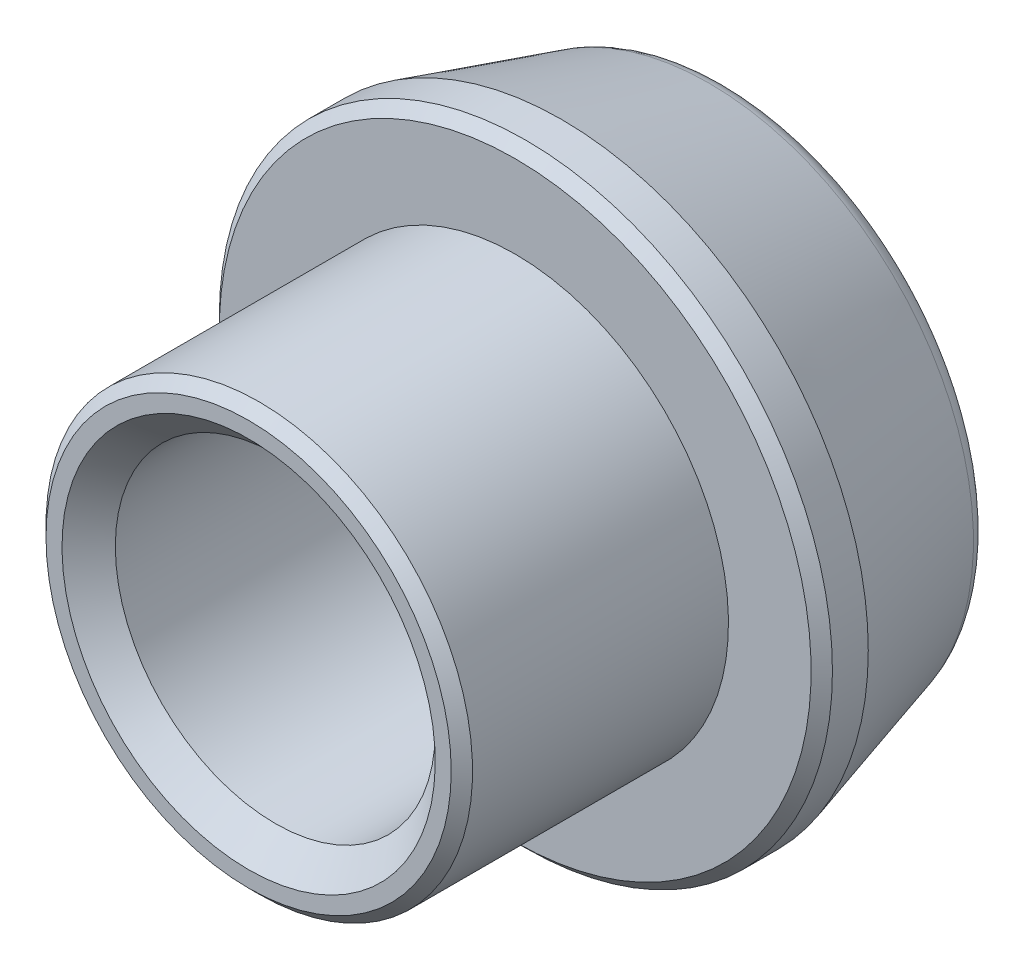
ISO-10303-21;
HEADER;
FILE_DESCRIPTION(('STEP AP214'),'2;1');
FILE_NAME('part.step','',(''),(''),'','','');
FILE_SCHEMA(('AUTOMOTIVE_DESIGN { 1 0 10303 214 1 1 1 1 }'));
ENDSEC;
DATA;
#1=APPLICATION_CONTEXT('core data for automotive mechanical design processes');
#2=APPLICATION_PROTOCOL_DEFINITION('international standard','automotive_design',2000,#1);
#3=PRODUCT_CONTEXT('',#1,'mechanical');
#4=PRODUCT('Part','Part','',(#3));
#5=PRODUCT_RELATED_PRODUCT_CATEGORY('part','',(#4));
#6=PRODUCT_DEFINITION_FORMATION('','',#4);
#7=PRODUCT_DEFINITION_CONTEXT('part definition',#1,'design');
#8=PRODUCT_DEFINITION('design','',#6,#7);
#9=PRODUCT_DEFINITION_SHAPE('','',#8);
#10=(LENGTH_UNIT() NAMED_UNIT(*) SI_UNIT(.MILLI.,.METRE.));
#11=(NAMED_UNIT(*) PLANE_ANGLE_UNIT() SI_UNIT($,.RADIAN.));
#12=(NAMED_UNIT(*) SI_UNIT($,.STERADIAN.) SOLID_ANGLE_UNIT());
#13=UNCERTAINTY_MEASURE_WITH_UNIT(LENGTH_MEASURE(1.E-05),#10,'distance_accuracy_value','');
#14=(GEOMETRIC_REPRESENTATION_CONTEXT(3) GLOBAL_UNCERTAINTY_ASSIGNED_CONTEXT((#13)) GLOBAL_UNIT_ASSIGNED_CONTEXT((#10,
#11,#12)) REPRESENTATION_CONTEXT('',''));
#15=CARTESIAN_POINT('',(0.,0.,0.));
#16=DIRECTION('',(0.,0.,1.));
#17=DIRECTION('',(1.,0.,0.));
#18=AXIS2_PLACEMENT_3D('',#15,#16,#17);
#19=CARTESIAN_POINT('',(0.,0.,0.));
#20=DIRECTION('',(0.,0.,-1.));
#21=DIRECTION('',(0.,1.,0.));
#22=AXIS2_PLACEMENT_3D('',#19,#20,#21);
#23=CYLINDRICAL_SURFACE('',#22,4.);
#24=CARTESIAN_POINT('',(0.,0.,4.8));
#25=DIRECTION('',(0.,0.,1.));
#26=DIRECTION('',(0.,-1.,0.));
#27=AXIS2_PLACEMENT_3D('',#24,#25,#26);
#28=CIRCLE('',#27,4.);
#29=CARTESIAN_POINT('',(0.,-4.,4.8));
#30=VERTEX_POINT('',#29);
#31=EDGE_CURVE('E20',#30,#30,#28,.F.);
#32=ORIENTED_EDGE('',*,*,#31,.T.);
#33=EDGE_LOOP('',(#32));
#34=FACE_BOUND('',#33,.T.);
#35=CARTESIAN_POINT('',(0.,0.,0.));
#36=DIRECTION('',(0.,0.,-1.));
#37=DIRECTION('',(0.,1.,0.));
#38=AXIS2_PLACEMENT_3D('',#35,#36,#37);
#39=CIRCLE('',#38,4.);
#40=CARTESIAN_POINT('',(0.,4.,0.));
#41=VERTEX_POINT('',#40);
#42=EDGE_CURVE('E44',#41,#41,#39,.T.);
#43=ORIENTED_EDGE('',*,*,#42,.F.);
#44=EDGE_LOOP('',(#43));
#45=FACE_BOUND('',#44,.T.);
#46=ADVANCED_FACE('F12',(#34,#45),#23,.T.);
#47=CARTESIAN_POINT('',(4.,0.,0.));
#48=DIRECTION('',(0.,0.,1.));
#49=DIRECTION('',(0.,-1.,0.));
#50=AXIS2_PLACEMENT_3D('',#47,#48,#49);
#51=PLANE('',#50);
#52=CARTESIAN_POINT('',(0.,0.,0.));
#53=DIRECTION('',(0.,0.,1.));
#54=DIRECTION('',(0.,-1.,0.));
#55=AXIS2_PLACEMENT_3D('',#52,#53,#54);
#56=CIRCLE('',#55,5.55);
#57=CARTESIAN_POINT('',(0.,-5.55,0.));
#58=VERTEX_POINT('',#57);
#59=EDGE_CURVE('E32',#58,#58,#56,.T.);
#60=ORIENTED_EDGE('',*,*,#59,.T.);
#61=EDGE_LOOP('',(#60));
#62=FACE_BOUND('',#61,.T.);
#63=ORIENTED_EDGE('',*,*,#42,.T.);
#64=EDGE_LOOP('',(#63));
#65=FACE_BOUND('',#64,.T.);
#66=ADVANCED_FACE('F83',(#62,#65),#51,.T.);
#67=CARTESIAN_POINT('',(0.,0.,0.));
#68=DIRECTION('',(0.,0.,-1.));
#69=DIRECTION('',(0.,1.,0.));
#70=AXIS2_PLACEMENT_3D('',#67,#68,#69);
#71=CYLINDRICAL_SURFACE('',#70,5.75);
#72=CARTESIAN_POINT('',(0.,0.,-0.199999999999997));
#73=DIRECTION('',(0.,0.,1.));
#74=DIRECTION('',(0.,-1.,0.));
#75=AXIS2_PLACEMENT_3D('',#72,#73,#74);
#76=CIRCLE('',#75,5.75);
#77=CARTESIAN_POINT('',(0.,-5.75,-0.199999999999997));
#78=VERTEX_POINT('',#77);
#79=EDGE_CURVE('E35',#78,#78,#76,.F.);
#80=ORIENTED_EDGE('',*,*,#79,.T.);
#81=EDGE_LOOP('',(#80));
#82=FACE_BOUND('',#81,.T.);
#83=CARTESIAN_POINT('',(0.,0.,-0.871853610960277));
#84=DIRECTION('',(0.,0.,-1.));
#85=DIRECTION('',(0.,1.,0.));
#86=AXIS2_PLACEMENT_3D('',#83,#84,#85);
#87=CIRCLE('',#86,5.75);
#88=CARTESIAN_POINT('',(0.,5.75,-0.871853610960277));
#89=VERTEX_POINT('',#88);
#90=EDGE_CURVE('E47',#89,#89,#87,.T.);
#91=ORIENTED_EDGE('',*,*,#90,.F.);
#92=EDGE_LOOP('',(#91));
#93=FACE_BOUND('',#92,.T.);
#94=ADVANCED_FACE('F89',(#82,#93),#71,.T.);
#95=CARTESIAN_POINT('',(0.,0.,-4.));
#96=DIRECTION('',(0.,0.,1.));
#97=DIRECTION('',(0.,-1.,0.));
#98=AXIS2_PLACEMENT_3D('',#95,#96,#97);
#99=CONICAL_SURFACE('',#98,4.85301845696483,0.279252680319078);
#100=CARTESIAN_POINT('',(0.,0.,-3.63781867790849));
#101=DIRECTION('',(0.,0.,-1.));
#102=DIRECTION('',(0.,1.,0.));
#103=AXIS2_PLACEMENT_3D('',#100,#101,#102);
#104=CIRCLE('',#103,4.95687227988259);
#105=CARTESIAN_POINT('',(0.,4.95687227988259,-3.63781867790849));
#106=VERTEX_POINT('',#105);
#107=EDGE_CURVE('E38',#106,#106,#104,.F.);
#108=ORIENTED_EDGE('',*,*,#107,.T.);
#109=EDGE_LOOP('',(#108));
#110=FACE_BOUND('',#109,.T.);
#111=ORIENTED_EDGE('',*,*,#90,.T.);
#112=EDGE_LOOP('',(#111));
#113=FACE_BOUND('',#112,.T.);
#114=ADVANCED_FACE('F78',(#110,#113),#99,.T.);
#115=CARTESIAN_POINT('',(2.5,0.,-4.));
#116=DIRECTION('',(0.,0.,-1.));
#117=DIRECTION('',(0.,1.,0.));
#118=AXIS2_PLACEMENT_3D('',#115,#116,#117);
#119=PLANE('',#118);
#120=CARTESIAN_POINT('',(0.,0.,-4.));
#121=DIRECTION('',(0.,0.,-1.));
#122=DIRECTION('',(0.,1.,0.));
#123=AXIS2_PLACEMENT_3D('',#120,#121,#122);
#124=CIRCLE('',#123,3.5);
#125=CARTESIAN_POINT('',(0.,3.5,-4.));
#126=VERTEX_POINT('',#125);
#127=EDGE_CURVE('E29',#126,#126,#124,.F.);
#128=ORIENTED_EDGE('',*,*,#127,.T.);
#129=EDGE_LOOP('',(#128));
#130=FACE_BOUND('',#129,.T.);
#131=CARTESIAN_POINT('',(0.,0.,-4.));
#132=DIRECTION('',(0.,0.,-1.));
#133=DIRECTION('',(0.,1.,0.));
#134=AXIS2_PLACEMENT_3D('',#131,#132,#133);
#135=CIRCLE('',#134,4.47624143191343);
#136=CARTESIAN_POINT('',(0.,4.47624143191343,-4.));
#137=VERTEX_POINT('',#136);
#138=EDGE_CURVE('E41',#137,#137,#135,.T.);
#139=ORIENTED_EDGE('',*,*,#138,.T.);
#140=EDGE_LOOP('',(#139));
#141=FACE_BOUND('',#140,.T.);
#142=ADVANCED_FACE('F68',(#130,#141),#119,.T.);
#143=CARTESIAN_POINT('',(2.5,0.,5.));
#144=DIRECTION('',(0.,0.,1.));
#145=DIRECTION('',(0.,-1.,0.));
#146=AXIS2_PLACEMENT_3D('',#143,#144,#145);
#147=PLANE('',#146);
#148=CARTESIAN_POINT('',(0.,0.,5.));
#149=DIRECTION('',(0.,0.,1.));
#150=DIRECTION('',(0.,-1.,0.));
#151=AXIS2_PLACEMENT_3D('',#148,#149,#150);
#152=CIRCLE('',#151,3.8);
#153=CARTESIAN_POINT('',(0.,-3.8,5.));
#154=VERTEX_POINT('',#153);
#155=EDGE_CURVE('E8',#154,#154,#152,.T.);
#156=ORIENTED_EDGE('',*,*,#155,.T.);
#157=EDGE_LOOP('',(#156));
#158=FACE_BOUND('',#157,.T.);
#159=CARTESIAN_POINT('',(0.,0.,5.));
#160=DIRECTION('',(0.,0.,1.));
#161=DIRECTION('',(0.,-1.,0.));
#162=AXIS2_PLACEMENT_3D('',#159,#160,#161);
#163=CIRCLE('',#162,3.5);
#164=CARTESIAN_POINT('',(0.,-3.5,5.));
#165=VERTEX_POINT('',#164);
#166=EDGE_CURVE('E24',#165,#165,#163,.F.);
#167=ORIENTED_EDGE('',*,*,#166,.T.);
#168=EDGE_LOOP('',(#167));
#169=FACE_BOUND('',#168,.T.);
#170=ADVANCED_FACE('F65',(#158,#169),#147,.T.);
#171=CARTESIAN_POINT('',(0.,0.,-3.5));
#172=DIRECTION('',(0.,0.,-1.));
#173=DIRECTION('',(0.,1.,0.));
#174=AXIS2_PLACEMENT_3D('',#171,#172,#173);
#175=TOROIDAL_SURFACE('',#174,4.47624143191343,0.5);
#176=ORIENTED_EDGE('',*,*,#107,.F.);
#177=EDGE_LOOP('',(#176));
#178=FACE_BOUND('',#177,.T.);
#179=ORIENTED_EDGE('',*,*,#138,.F.);
#180=EDGE_LOOP('',(#179));
#181=FACE_BOUND('',#180,.T.);
#182=ADVANCED_FACE('F67',(#178,#181),#175,.T.);
#183=CARTESIAN_POINT('',(0.,0.,-0.199999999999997));
#184=DIRECTION('',(0.,0.,-1.));
#185=DIRECTION('',(0.,1.,0.));
#186=AXIS2_PLACEMENT_3D('',#183,#184,#185);
#187=CONICAL_SURFACE('',#186,5.75,0.785398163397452);
#188=ORIENTED_EDGE('',*,*,#59,.F.);
#189=EDGE_LOOP('',(#188));
#190=FACE_BOUND('',#189,.T.);
#191=ORIENTED_EDGE('',*,*,#79,.F.);
#192=EDGE_LOOP('',(#191));
#193=FACE_BOUND('',#192,.T.);
#194=ADVANCED_FACE('F75',(#190,#193),#187,.T.);
#195=CARTESIAN_POINT('',(0.,0.,-3.));
#196=DIRECTION('',(0.,0.,-1.));
#197=DIRECTION('',(0.,1.,0.));
#198=AXIS2_PLACEMENT_3D('',#195,#196,#197);
#199=CONICAL_SURFACE('',#198,2.5,0.78539816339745);
#200=CARTESIAN_POINT('',(0.,0.,-3.5));
#201=DIRECTION('',(0.,0.,-1.));
#202=DIRECTION('',(0.,1.,0.));
#203=AXIS2_PLACEMENT_3D('',#200,#201,#202);
#204=CIRCLE('',#203,3.);
#205=CARTESIAN_POINT('',(0.,3.,-3.5));
#206=VERTEX_POINT('',#205);
#207=EDGE_CURVE('E50',#206,#206,#204,.T.);
#208=ORIENTED_EDGE('',*,*,#207,.F.);
#209=EDGE_LOOP('',(#208));
#210=FACE_BOUND('',#209,.T.);
#211=ORIENTED_EDGE('',*,*,#127,.F.);
#212=EDGE_LOOP('',(#211));
#213=FACE_BOUND('',#212,.T.);
#214=ADVANCED_FACE('F62',(#210,#213),#199,.F.);
#215=CARTESIAN_POINT('',(0.,0.,5.));
#216=DIRECTION('',(0.,0.,1.));
#217=DIRECTION('',(0.,-1.,0.));
#218=AXIS2_PLACEMENT_3D('',#215,#216,#217);
#219=CONICAL_SURFACE('',#218,3.5,0.785398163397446);
#220=CARTESIAN_POINT('',(0.,0.,4.5));
#221=DIRECTION('',(0.,0.,1.));
#222=DIRECTION('',(0.,-1.,0.));
#223=AXIS2_PLACEMENT_3D('',#220,#221,#222);
#224=CIRCLE('',#223,3.);
#225=CARTESIAN_POINT('',(0.,-3.,4.5));
#226=VERTEX_POINT('',#225);
#227=EDGE_CURVE('E16',#226,#226,#224,.T.);
#228=ORIENTED_EDGE('',*,*,#227,.F.);
#229=EDGE_LOOP('',(#228));
#230=FACE_BOUND('',#229,.T.);
#231=ORIENTED_EDGE('',*,*,#166,.F.);
#232=EDGE_LOOP('',(#231));
#233=FACE_BOUND('',#232,.T.);
#234=ADVANCED_FACE('F59',(#230,#233),#219,.F.);
#235=CARTESIAN_POINT('',(0.,0.,4.8));
#236=DIRECTION('',(0.,0.,-1.));
#237=DIRECTION('',(0.,1.,0.));
#238=AXIS2_PLACEMENT_3D('',#235,#236,#237);
#239=CONICAL_SURFACE('',#238,4.,0.785398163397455);
#240=ORIENTED_EDGE('',*,*,#155,.F.);
#241=EDGE_LOOP('',(#240));
#242=FACE_BOUND('',#241,.T.);
#243=ORIENTED_EDGE('',*,*,#31,.F.);
#244=EDGE_LOOP('',(#243));
#245=FACE_BOUND('',#244,.T.);
#246=ADVANCED_FACE('F14',(#242,#245),#239,.T.);
#247=CARTESIAN_POINT('',(0.,0.,-4.));
#248=DIRECTION('',(0.,0.,1.));
#249=DIRECTION('',(0.,-1.,0.));
#250=AXIS2_PLACEMENT_3D('',#247,#248,#249);
#251=CYLINDRICAL_SURFACE('',#250,3.);
#252=ORIENTED_EDGE('',*,*,#207,.T.);
#253=EDGE_LOOP('',(#252));
#254=FACE_BOUND('',#253,.T.);
#255=ORIENTED_EDGE('',*,*,#227,.T.);
#256=EDGE_LOOP('',(#255));
#257=FACE_BOUND('',#256,.T.);
#258=ADVANCED_FACE('F57',(#254,#257),#251,.F.);
#259=CLOSED_SHELL('',(#46,#66,#94,#114,#142,#170,#182,#194,#214,#234,#246,#258));
#260=MANIFOLD_SOLID_BREP('B1',#259);
#261=ADVANCED_BREP_SHAPE_REPRESENTATION('',(#18,#260),#14);
#262=SHAPE_DEFINITION_REPRESENTATION(#9,#261);
ENDSEC;
END-ISO-10303-21;
